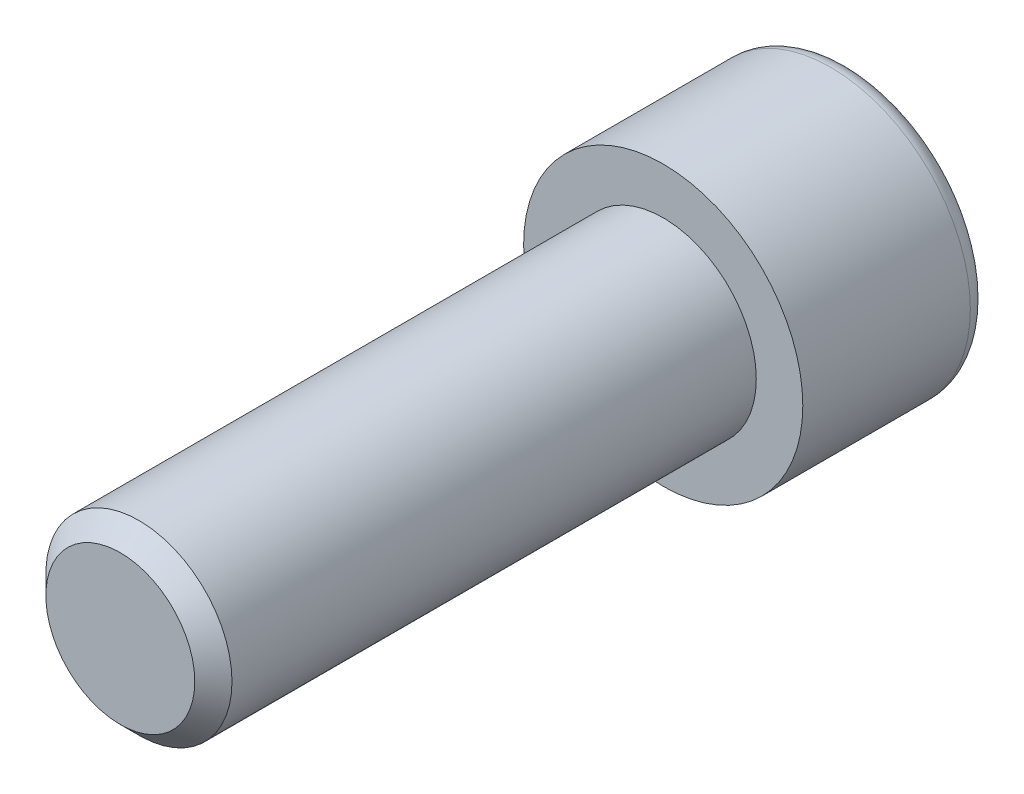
ISO-10303-21;
HEADER;
FILE_DESCRIPTION(('STEP AP214'),'2;1');
FILE_NAME('part.step','',(''),(''),'','','');
FILE_SCHEMA(('AUTOMOTIVE_DESIGN { 1 0 10303 214 1 1 1 1 }'));
ENDSEC;
DATA;
#1=APPLICATION_CONTEXT('core data for automotive mechanical design processes');
#2=APPLICATION_PROTOCOL_DEFINITION('international standard','automotive_design',2000,#1);
#3=PRODUCT_CONTEXT('',#1,'mechanical');
#4=PRODUCT('Part','Part','',(#3));
#5=PRODUCT_RELATED_PRODUCT_CATEGORY('part','',(#4));
#6=PRODUCT_DEFINITION_FORMATION('','',#4);
#7=PRODUCT_DEFINITION_CONTEXT('part definition',#1,'design');
#8=PRODUCT_DEFINITION('design','',#6,#7);
#9=PRODUCT_DEFINITION_SHAPE('','',#8);
#10=(LENGTH_UNIT() NAMED_UNIT(*) SI_UNIT(.MILLI.,.METRE.));
#11=(NAMED_UNIT(*) PLANE_ANGLE_UNIT() SI_UNIT($,.RADIAN.));
#12=(NAMED_UNIT(*) SI_UNIT($,.STERADIAN.) SOLID_ANGLE_UNIT());
#13=UNCERTAINTY_MEASURE_WITH_UNIT(LENGTH_MEASURE(1.E-05),#10,'distance_accuracy_value','');
#14=(GEOMETRIC_REPRESENTATION_CONTEXT(3) GLOBAL_UNCERTAINTY_ASSIGNED_CONTEXT((#13)) GLOBAL_UNIT_ASSIGNED_CONTEXT((#10,
#11,#12)) REPRESENTATION_CONTEXT('',''));
#15=CARTESIAN_POINT('',(0.,0.,0.));
#16=DIRECTION('',(0.,0.,1.));
#17=DIRECTION('',(1.,0.,0.));
#18=AXIS2_PLACEMENT_3D('',#15,#16,#17);
#19=CARTESIAN_POINT('',(0.,0.,-12.));
#20=DIRECTION('',(0.,0.,1.));
#21=DIRECTION('',(1.,0.,0.));
#22=AXIS2_PLACEMENT_3D('',#19,#20,#21);
#23=PLANE('',#22);
#24=CARTESIAN_POINT('',(0.,0.,-12.));
#25=DIRECTION('',(0.,0.,-1.));
#26=DIRECTION('',(-1.,0.,0.));
#27=AXIS2_PLACEMENT_3D('',#24,#25,#26);
#28=CIRCLE('',#27,7.8);
#29=CARTESIAN_POINT('',(-7.8,0.,-12.));
#30=VERTEX_POINT('',#29);
#31=EDGE_CURVE('E458',#30,#30,#28,.T.);
#32=ORIENTED_EDGE('',*,*,#31,.T.);
#33=EDGE_LOOP('',(#32));
#34=FACE_BOUND('',#33,.T.);
#35=DIRECTION('',(-0.86602540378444,0.499999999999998,0.));
#36=VECTOR('',#35,1.);
#37=CARTESIAN_POINT('',(0.,5.77350269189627,-12.));
#38=LINE('',#37,#36);
#39=CARTESIAN_POINT('',(5.,2.88675134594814,-12.));
#40=VERTEX_POINT('',#39);
#41=CARTESIAN_POINT('',(0.,5.77350269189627,-12.));
#42=VERTEX_POINT('',#41);
#43=EDGE_CURVE('E362',#40,#42,#38,.T.);
#44=ORIENTED_EDGE('',*,*,#43,.T.);
#45=DIRECTION('',(-0.866025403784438,-0.500000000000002,0.));
#46=VECTOR('',#45,1.);
#47=CARTESIAN_POINT('',(0.,5.77350269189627,-12.));
#48=LINE('',#47,#46);
#49=CARTESIAN_POINT('',(-5.,2.88675134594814,-12.));
#50=VERTEX_POINT('',#49);
#51=EDGE_CURVE('E402',#42,#50,#48,.T.);
#52=ORIENTED_EDGE('',*,*,#51,.T.);
#53=DIRECTION('',(0.,-1.,0.));
#54=VECTOR('',#53,1.);
#55=CARTESIAN_POINT('',(-5.,-2.88675134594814,-12.));
#56=LINE('',#55,#54);
#57=CARTESIAN_POINT('',(-5.,-2.88675134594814,-12.));
#58=VERTEX_POINT('',#57);
#59=EDGE_CURVE('E410',#50,#58,#56,.T.);
#60=ORIENTED_EDGE('',*,*,#59,.T.);
#61=DIRECTION('',(0.866025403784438,-0.500000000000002,0.));
#62=VECTOR('',#61,1.);
#63=CARTESIAN_POINT('',(0.,-5.77350269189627,-12.));
#64=LINE('',#63,#62);
#65=CARTESIAN_POINT('',(0.,-5.77350269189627,-12.));
#66=VERTEX_POINT('',#65);
#67=EDGE_CURVE('E428',#58,#66,#64,.T.);
#68=ORIENTED_EDGE('',*,*,#67,.T.);
#69=DIRECTION('',(0.86602540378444,0.499999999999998,0.));
#70=VECTOR('',#69,1.);
#71=CARTESIAN_POINT('',(0.,-5.77350269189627,-12.));
#72=LINE('',#71,#70);
#73=CARTESIAN_POINT('',(5.,-2.88675134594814,-12.));
#74=VERTEX_POINT('',#73);
#75=EDGE_CURVE('E431',#66,#74,#72,.T.);
#76=ORIENTED_EDGE('',*,*,#75,.T.);
#77=DIRECTION('',(0.,1.,0.));
#78=VECTOR('',#77,1.);
#79=CARTESIAN_POINT('',(5.,-2.88675134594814,-12.));
#80=LINE('',#79,#78);
#81=EDGE_CURVE('E421',#74,#40,#80,.T.);
#82=ORIENTED_EDGE('',*,*,#81,.T.);
#83=EDGE_LOOP('',(#44,#52,#60,#68,#76,#82));
#84=FACE_BOUND('',#83,.T.);
#85=ADVANCED_FACE('F348',(#34,#84),#23,.F.);
#86=CARTESIAN_POINT('',(0.,0.,-10.8));
#87=DIRECTION('',(0.,0.,-1.));
#88=DIRECTION('',(-1.,0.,0.));
#89=AXIS2_PLACEMENT_3D('',#86,#87,#88);
#90=TOROIDAL_SURFACE('',#89,7.8,1.2);
#91=ORIENTED_EDGE('',*,*,#31,.F.);
#92=EDGE_LOOP('',(#91));
#93=FACE_BOUND('',#92,.T.);
#94=CARTESIAN_POINT('',(0.,0.,-10.8));
#95=DIRECTION('',(0.,0.,-1.));
#96=DIRECTION('',(-1.,0.,0.));
#97=AXIS2_PLACEMENT_3D('',#94,#95,#96);
#98=CIRCLE('',#97,9.);
#99=CARTESIAN_POINT('',(-9.,0.,-10.8));
#100=VERTEX_POINT('',#99);
#101=EDGE_CURVE('E455',#100,#100,#98,.T.);
#102=ORIENTED_EDGE('',*,*,#101,.T.);
#103=EDGE_LOOP('',(#102));
#104=FACE_BOUND('',#103,.T.);
#105=ADVANCED_FACE('F477',(#93,#104),#90,.T.);
#106=CARTESIAN_POINT('',(0.,0.,0.));
#107=DIRECTION('',(0.,0.,-1.));
#108=DIRECTION('',(-1.,0.,0.));
#109=AXIS2_PLACEMENT_3D('',#106,#107,#108);
#110=CYLINDRICAL_SURFACE('',#109,9.);
#111=ORIENTED_EDGE('',*,*,#101,.F.);
#112=EDGE_LOOP('',(#111));
#113=FACE_BOUND('',#112,.T.);
#114=CARTESIAN_POINT('',(0.,0.,0.));
#115=DIRECTION('',(0.,0.,-1.));
#116=DIRECTION('',(-1.,0.,0.));
#117=AXIS2_PLACEMENT_3D('',#114,#115,#116);
#118=CIRCLE('',#117,9.);
#119=CARTESIAN_POINT('',(-9.,0.,0.));
#120=VERTEX_POINT('',#119);
#121=EDGE_CURVE('E416',#120,#120,#118,.T.);
#122=ORIENTED_EDGE('',*,*,#121,.T.);
#123=EDGE_LOOP('',(#122));
#124=FACE_BOUND('',#123,.T.);
#125=ADVANCED_FACE('F482',(#113,#124),#110,.T.);
#126=CARTESIAN_POINT('',(0.,0.,0.));
#127=DIRECTION('',(0.,0.,-1.));
#128=DIRECTION('',(-1.,0.,0.));
#129=AXIS2_PLACEMENT_3D('',#126,#127,#128);
#130=PLANE('',#129);
#131=CARTESIAN_POINT('',(0.,0.,0.));
#132=DIRECTION('',(0.,0.,1.));
#133=DIRECTION('',(1.,0.,0.));
#134=AXIS2_PLACEMENT_3D('',#131,#132,#133);
#135=CIRCLE('',#134,6.);
#136=CARTESIAN_POINT('',(6.,0.,0.));
#137=VERTEX_POINT('',#136);
#138=EDGE_CURVE('E422',#137,#137,#135,.T.);
#139=ORIENTED_EDGE('',*,*,#138,.F.);
#140=EDGE_LOOP('',(#139));
#141=FACE_BOUND('',#140,.T.);
#142=ORIENTED_EDGE('',*,*,#121,.F.);
#143=EDGE_LOOP('',(#142));
#144=FACE_BOUND('',#143,.T.);
#145=ADVANCED_FACE('F490',(#141,#144),#130,.F.);
#146=CARTESIAN_POINT('',(0.,5.77350269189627,-5.));
#147=DIRECTION('',(-0.499999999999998,-0.86602540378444,0.));
#148=DIRECTION('',(0.86602540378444,-0.499999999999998,0.));
#149=AXIS2_PLACEMENT_3D('',#146,#147,#148);
#150=PLANE('',#149);
#151=ORIENTED_EDGE('',*,*,#43,.F.);
#152=DIRECTION('',(0.,0.,-1.));
#153=VECTOR('',#152,1.);
#154=CARTESIAN_POINT('',(5.,2.88675134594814,-5.));
#155=LINE('',#154,#153);
#156=CARTESIAN_POINT('',(5.,2.88675134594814,-5.));
#157=VERTEX_POINT('',#156);
#158=EDGE_CURVE('E444',#157,#40,#155,.T.);
#159=ORIENTED_EDGE('',*,*,#158,.F.);
#160=DIRECTION('',(-0.86602540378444,0.499999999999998,0.));
#161=VECTOR('',#160,1.);
#162=CARTESIAN_POINT('',(0.,5.77350269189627,-5.));
#163=LINE('',#162,#161);
#164=CARTESIAN_POINT('',(0.,5.77350269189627,-5.));
#165=VERTEX_POINT('',#164);
#166=EDGE_CURVE('E415',#157,#165,#163,.T.);
#167=ORIENTED_EDGE('',*,*,#166,.T.);
#168=DIRECTION('',(0.,0.,-1.));
#169=VECTOR('',#168,1.);
#170=CARTESIAN_POINT('',(0.,5.77350269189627,-5.));
#171=LINE('',#170,#169);
#172=EDGE_CURVE('E404',#165,#42,#171,.T.);
#173=ORIENTED_EDGE('',*,*,#172,.T.);
#174=EDGE_LOOP('',(#151,#159,#167,#173));
#175=FACE_BOUND('',#174,.T.);
#176=ADVANCED_FACE('F413',(#175),#150,.T.);
#177=CARTESIAN_POINT('',(0.,5.77350269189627,-5.));
#178=DIRECTION('',(0.500000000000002,-0.866025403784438,0.));
#179=DIRECTION('',(0.866025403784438,0.500000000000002,0.));
#180=AXIS2_PLACEMENT_3D('',#177,#178,#179);
#181=PLANE('',#180);
#182=ORIENTED_EDGE('',*,*,#51,.F.);
#183=ORIENTED_EDGE('',*,*,#172,.F.);
#184=DIRECTION('',(-0.866025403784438,-0.500000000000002,0.));
#185=VECTOR('',#184,1.);
#186=CARTESIAN_POINT('',(0.,5.77350269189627,-5.));
#187=LINE('',#186,#185);
#188=CARTESIAN_POINT('',(-5.,2.88675134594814,-5.));
#189=VERTEX_POINT('',#188);
#190=EDGE_CURVE('E435',#165,#189,#187,.T.);
#191=ORIENTED_EDGE('',*,*,#190,.T.);
#192=DIRECTION('',(0.,0.,-1.));
#193=VECTOR('',#192,1.);
#194=CARTESIAN_POINT('',(-5.,2.88675134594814,-5.));
#195=LINE('',#194,#193);
#196=EDGE_CURVE('E406',#189,#50,#195,.T.);
#197=ORIENTED_EDGE('',*,*,#196,.T.);
#198=EDGE_LOOP('',(#182,#183,#191,#197));
#199=FACE_BOUND('',#198,.T.);
#200=ADVANCED_FACE('F403',(#199),#181,.T.);
#201=CARTESIAN_POINT('',(-5.,-2.88675134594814,-5.));
#202=DIRECTION('',(1.,0.,0.));
#203=DIRECTION('',(0.,0.,-1.));
#204=AXIS2_PLACEMENT_3D('',#201,#202,#203);
#205=PLANE('',#204);
#206=ORIENTED_EDGE('',*,*,#59,.F.);
#207=ORIENTED_EDGE('',*,*,#196,.F.);
#208=DIRECTION('',(0.,-1.,0.));
#209=VECTOR('',#208,1.);
#210=CARTESIAN_POINT('',(-5.,-2.88675134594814,-5.));
#211=LINE('',#210,#209);
#212=CARTESIAN_POINT('',(-5.,-2.88675134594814,-5.));
#213=VERTEX_POINT('',#212);
#214=EDGE_CURVE('E437',#189,#213,#211,.T.);
#215=ORIENTED_EDGE('',*,*,#214,.T.);
#216=DIRECTION('',(0.,0.,-1.));
#217=VECTOR('',#216,1.);
#218=CARTESIAN_POINT('',(-5.,-2.88675134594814,-5.));
#219=LINE('',#218,#217);
#220=EDGE_CURVE('E450',#213,#58,#219,.T.);
#221=ORIENTED_EDGE('',*,*,#220,.T.);
#222=EDGE_LOOP('',(#206,#207,#215,#221));
#223=FACE_BOUND('',#222,.T.);
#224=ADVANCED_FACE('F505',(#223),#205,.T.);
#225=CARTESIAN_POINT('',(0.,-5.77350269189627,-5.));
#226=DIRECTION('',(0.500000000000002,0.866025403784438,0.));
#227=DIRECTION('',(-0.866025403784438,0.500000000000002,0.));
#228=AXIS2_PLACEMENT_3D('',#225,#226,#227);
#229=PLANE('',#228);
#230=ORIENTED_EDGE('',*,*,#67,.F.);
#231=ORIENTED_EDGE('',*,*,#220,.F.);
#232=DIRECTION('',(0.866025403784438,-0.500000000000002,0.));
#233=VECTOR('',#232,1.);
#234=CARTESIAN_POINT('',(0.,-5.77350269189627,-5.));
#235=LINE('',#234,#233);
#236=CARTESIAN_POINT('',(0.,-5.77350269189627,-5.));
#237=VERTEX_POINT('',#236);
#238=EDGE_CURVE('E439',#213,#237,#235,.T.);
#239=ORIENTED_EDGE('',*,*,#238,.T.);
#240=DIRECTION('',(0.,0.,-1.));
#241=VECTOR('',#240,1.);
#242=CARTESIAN_POINT('',(0.,-5.77350269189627,-5.));
#243=LINE('',#242,#241);
#244=EDGE_CURVE('E448',#237,#66,#243,.T.);
#245=ORIENTED_EDGE('',*,*,#244,.T.);
#246=EDGE_LOOP('',(#230,#231,#239,#245));
#247=FACE_BOUND('',#246,.T.);
#248=ADVANCED_FACE('F508',(#247),#229,.T.);
#249=CARTESIAN_POINT('',(0.,-5.77350269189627,-5.));
#250=DIRECTION('',(-0.499999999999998,0.86602540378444,0.));
#251=DIRECTION('',(-0.86602540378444,-0.499999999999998,0.));
#252=AXIS2_PLACEMENT_3D('',#249,#250,#251);
#253=PLANE('',#252);
#254=ORIENTED_EDGE('',*,*,#75,.F.);
#255=ORIENTED_EDGE('',*,*,#244,.F.);
#256=DIRECTION('',(0.86602540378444,0.499999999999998,0.));
#257=VECTOR('',#256,1.);
#258=CARTESIAN_POINT('',(0.,-5.77350269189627,-5.));
#259=LINE('',#258,#257);
#260=CARTESIAN_POINT('',(5.,-2.88675134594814,-5.));
#261=VERTEX_POINT('',#260);
#262=EDGE_CURVE('E441',#237,#261,#259,.T.);
#263=ORIENTED_EDGE('',*,*,#262,.T.);
#264=DIRECTION('',(0.,0.,-1.));
#265=VECTOR('',#264,1.);
#266=CARTESIAN_POINT('',(5.,-2.88675134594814,-5.));
#267=LINE('',#266,#265);
#268=EDGE_CURVE('E446',#261,#74,#267,.T.);
#269=ORIENTED_EDGE('',*,*,#268,.T.);
#270=EDGE_LOOP('',(#254,#255,#263,#269));
#271=FACE_BOUND('',#270,.T.);
#272=ADVANCED_FACE('F512',(#271),#253,.T.);
#273=CARTESIAN_POINT('',(5.,-2.88675134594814,-5.));
#274=DIRECTION('',(-1.,0.,0.));
#275=DIRECTION('',(0.,-1.,0.));
#276=AXIS2_PLACEMENT_3D('',#273,#274,#275);
#277=PLANE('',#276);
#278=ORIENTED_EDGE('',*,*,#81,.F.);
#279=ORIENTED_EDGE('',*,*,#268,.F.);
#280=DIRECTION('',(0.,1.,0.));
#281=VECTOR('',#280,1.);
#282=CARTESIAN_POINT('',(5.,-2.88675134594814,-5.));
#283=LINE('',#282,#281);
#284=EDGE_CURVE('E369',#261,#157,#283,.T.);
#285=ORIENTED_EDGE('',*,*,#284,.T.);
#286=ORIENTED_EDGE('',*,*,#158,.T.);
#287=EDGE_LOOP('',(#278,#279,#285,#286));
#288=FACE_BOUND('',#287,.T.);
#289=ADVANCED_FACE('F516',(#288),#277,.T.);
#290=CARTESIAN_POINT('',(5.,2.88675134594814,-5.));
#291=DIRECTION('',(0.,0.,1.));
#292=DIRECTION('',(1.,0.,0.));
#293=AXIS2_PLACEMENT_3D('',#290,#291,#292);
#294=PLANE('',#293);
#295=ORIENTED_EDGE('',*,*,#166,.F.);
#296=ORIENTED_EDGE('',*,*,#284,.F.);
#297=ORIENTED_EDGE('',*,*,#262,.F.);
#298=ORIENTED_EDGE('',*,*,#238,.F.);
#299=ORIENTED_EDGE('',*,*,#214,.F.);
#300=ORIENTED_EDGE('',*,*,#190,.F.);
#301=EDGE_LOOP('',(#295,#296,#297,#298,#299,#300));
#302=FACE_BOUND('',#301,.T.);
#303=ADVANCED_FACE('F520',(#302),#294,.F.);
#304=CARTESIAN_POINT('',(0.,0.,35.));
#305=DIRECTION('',(0.,0.,1.));
#306=DIRECTION('',(1.,0.,0.));
#307=AXIS2_PLACEMENT_3D('',#304,#305,#306);
#308=PLANE('',#307);
#309=CARTESIAN_POINT('',(0.,0.,35.));
#310=DIRECTION('',(0.,0.,1.));
#311=DIRECTION('',(1.,0.,0.));
#312=AXIS2_PLACEMENT_3D('',#309,#310,#311);
#313=CIRCLE('',#312,4.8);
#314=CARTESIAN_POINT('',(4.80000000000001,0.,35.));
#315=VERTEX_POINT('',#314);
#316=EDGE_CURVE('E355',#315,#315,#313,.T.);
#317=ORIENTED_EDGE('',*,*,#316,.T.);
#318=EDGE_LOOP('',(#317));
#319=FACE_BOUND('',#318,.T.);
#320=ADVANCED_FACE('F463',(#319),#308,.T.);
#321=CARTESIAN_POINT('',(0.,0.,0.));
#322=DIRECTION('',(0.,0.,1.));
#323=DIRECTION('',(1.,0.,0.));
#324=AXIS2_PLACEMENT_3D('',#321,#322,#323);
#325=CYLINDRICAL_SURFACE('',#324,6.);
#326=CARTESIAN_POINT('',(0.,0.,33.8));
#327=DIRECTION('',(0.,0.,1.));
#328=DIRECTION('',(1.,0.,0.));
#329=AXIS2_PLACEMENT_3D('',#326,#327,#328);
#330=CIRCLE('',#329,6.);
#331=CARTESIAN_POINT('',(6.,0.,33.8));
#332=VERTEX_POINT('',#331);
#333=EDGE_CURVE('E11',#332,#332,#330,.F.);
#334=ORIENTED_EDGE('',*,*,#333,.T.);
#335=EDGE_LOOP('',(#334));
#336=FACE_BOUND('',#335,.T.);
#337=ORIENTED_EDGE('',*,*,#138,.T.);
#338=EDGE_LOOP('',(#337));
#339=FACE_BOUND('',#338,.T.);
#340=ADVANCED_FACE('F467',(#336,#339),#325,.T.);
#341=CARTESIAN_POINT('',(0.,0.,35.));
#342=DIRECTION('',(0.,0.,-1.));
#343=DIRECTION('',(-1.,0.,0.));
#344=AXIS2_PLACEMENT_3D('',#341,#342,#343);
#345=CONICAL_SURFACE('',#344,4.8,0.785398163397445);
#346=ORIENTED_EDGE('',*,*,#333,.F.);
#347=EDGE_LOOP('',(#346));
#348=FACE_BOUND('',#347,.T.);
#349=ORIENTED_EDGE('',*,*,#316,.F.);
#350=EDGE_LOOP('',(#349));
#351=FACE_BOUND('',#350,.T.);
#352=ADVANCED_FACE('F465',(#348,#351),#345,.T.);
#353=CLOSED_SHELL('',(#85,#105,#125,#145,#176,#200,#224,#248,#272,#289,#303,#320,#340,#352));
#354=MANIFOLD_SOLID_BREP('B2',#353);
#355=ADVANCED_BREP_SHAPE_REPRESENTATION('',(#18,#354),#14);
#356=SHAPE_DEFINITION_REPRESENTATION(#9,#355);
ENDSEC;
END-ISO-10303-21;
